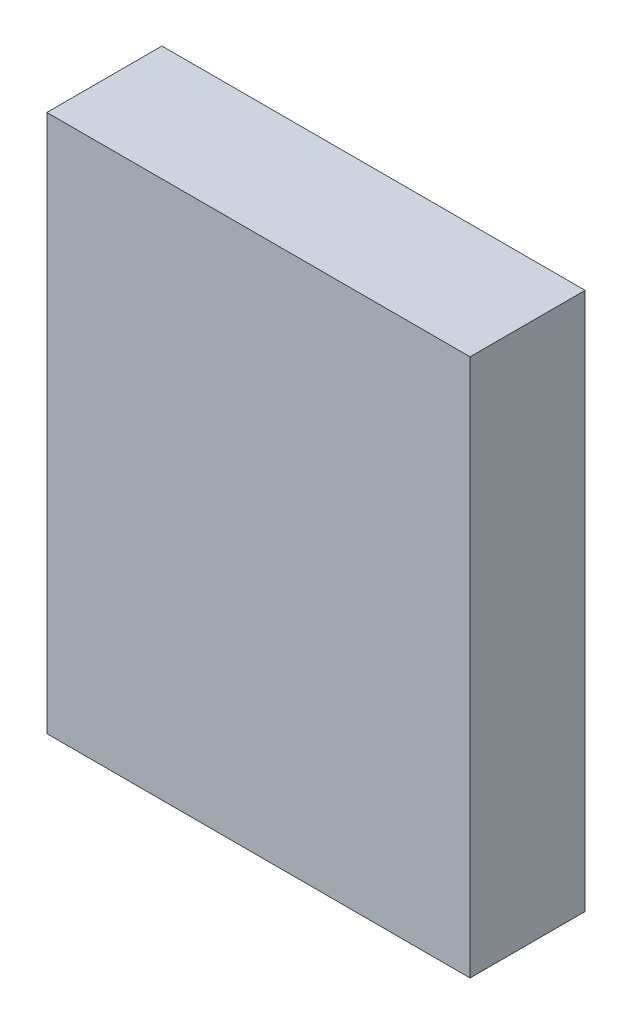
ISO-10303-21;
HEADER;
FILE_DESCRIPTION(('STEP AP214'),'2;1');
FILE_NAME('part.step','',(''),(''),'','','');
FILE_SCHEMA(('AUTOMOTIVE_DESIGN { 1 0 10303 214 1 1 1 1 }'));
ENDSEC;
DATA;
#1=APPLICATION_CONTEXT('core data for automotive mechanical design processes');
#2=APPLICATION_PROTOCOL_DEFINITION('international standard','automotive_design',2000,#1);
#3=PRODUCT_CONTEXT('',#1,'mechanical');
#4=PRODUCT('Part','Part','',(#3));
#5=PRODUCT_RELATED_PRODUCT_CATEGORY('part','',(#4));
#6=PRODUCT_DEFINITION_FORMATION('','',#4);
#7=PRODUCT_DEFINITION_CONTEXT('part definition',#1,'design');
#8=PRODUCT_DEFINITION('design','',#6,#7);
#9=PRODUCT_DEFINITION_SHAPE('','',#8);
#10=(LENGTH_UNIT() NAMED_UNIT(*) SI_UNIT(.MILLI.,.METRE.));
#11=(NAMED_UNIT(*) PLANE_ANGLE_UNIT() SI_UNIT($,.RADIAN.));
#12=(NAMED_UNIT(*) SI_UNIT($,.STERADIAN.) SOLID_ANGLE_UNIT());
#13=UNCERTAINTY_MEASURE_WITH_UNIT(LENGTH_MEASURE(1.E-05),#10,'distance_accuracy_value','');
#14=(GEOMETRIC_REPRESENTATION_CONTEXT(3) GLOBAL_UNCERTAINTY_ASSIGNED_CONTEXT((#13)) GLOBAL_UNIT_ASSIGNED_CONTEXT((#10,
#11,#12)) REPRESENTATION_CONTEXT('',''));
#15=CARTESIAN_POINT('',(0.,0.,0.));
#16=DIRECTION('',(0.,0.,1.));
#17=DIRECTION('',(1.,0.,0.));
#18=AXIS2_PLACEMENT_3D('',#15,#16,#17);
#19=CARTESIAN_POINT('',(0.,0.,0.750000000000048));
#20=DIRECTION('',(0.,0.,1.));
#21=DIRECTION('',(1.,0.,0.));
#22=AXIS2_PLACEMENT_3D('',#19,#20,#21);
#23=PLANE('',#22);
#24=DIRECTION('',(0.,1.,0.));
#25=VECTOR('',#24,1.);
#26=CARTESIAN_POINT('',(-1.37500000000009,1.75600000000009,0.750000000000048));
#27=LINE('',#26,#25);
#28=CARTESIAN_POINT('',(-1.37500000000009,-1.75000000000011,0.750000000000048));
#29=VERTEX_POINT('',#28);
#30=CARTESIAN_POINT('',(-1.37500000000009,1.75600000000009,0.750000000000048));
#31=VERTEX_POINT('',#30);
#32=EDGE_CURVE('E67',#29,#31,#27,.T.);
#33=ORIENTED_EDGE('',*,*,#32,.F.);
#34=DIRECTION('',(1.,0.,0.));
#35=VECTOR('',#34,1.);
#36=CARTESIAN_POINT('',(-1.37500000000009,-1.75000000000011,0.750000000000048));
#37=LINE('',#36,#35);
#38=CARTESIAN_POINT('',(1.38300000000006,-1.75000000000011,0.750000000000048));
#39=VERTEX_POINT('',#38);
#40=EDGE_CURVE('E19',#39,#29,#37,.F.);
#41=ORIENTED_EDGE('',*,*,#40,.F.);
#42=DIRECTION('',(0.,1.,0.));
#43=VECTOR('',#42,1.);
#44=CARTESIAN_POINT('',(1.38300000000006,-1.75000000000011,0.750000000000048));
#45=LINE('',#44,#43);
#46=CARTESIAN_POINT('',(1.38300000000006,1.75600000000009,0.750000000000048));
#47=VERTEX_POINT('',#46);
#48=EDGE_CURVE('E57',#47,#39,#45,.F.);
#49=ORIENTED_EDGE('',*,*,#48,.F.);
#50=DIRECTION('',(1.,0.,0.));
#51=VECTOR('',#50,1.);
#52=CARTESIAN_POINT('',(1.38300000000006,1.75600000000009,0.750000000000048));
#53=LINE('',#52,#51);
#54=EDGE_CURVE('E52',#31,#47,#53,.T.);
#55=ORIENTED_EDGE('',*,*,#54,.F.);
#56=EDGE_LOOP('',(#33,#41,#49,#55));
#57=FACE_BOUND('',#56,.T.);
#58=ADVANCED_FACE('F16',(#57),#23,.T.);
#59=CARTESIAN_POINT('',(-1.37500000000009,-1.75000000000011,0.));
#60=DIRECTION('',(0.,-1.,0.));
#61=DIRECTION('',(0.,0.,-1.));
#62=AXIS2_PLACEMENT_3D('',#59,#60,#61);
#63=PLANE('',#62);
#64=DIRECTION('',(0.,0.,1.));
#65=VECTOR('',#64,1.);
#66=CARTESIAN_POINT('',(-1.37500000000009,-1.75000000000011,0.));
#67=LINE('',#66,#65);
#68=CARTESIAN_POINT('',(-1.37500000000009,-1.75000000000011,0.));
#69=VERTEX_POINT('',#68);
#70=EDGE_CURVE('E78',#69,#29,#67,.T.);
#71=ORIENTED_EDGE('',*,*,#70,.F.);
#72=DIRECTION('',(1.,0.,0.));
#73=VECTOR('',#72,1.);
#74=CARTESIAN_POINT('',(0.,-1.75000000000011,0.));
#75=LINE('',#74,#73);
#76=CARTESIAN_POINT('',(1.38300000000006,-1.75000000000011,0.));
#77=VERTEX_POINT('',#76);
#78=EDGE_CURVE('E73',#69,#77,#75,.T.);
#79=ORIENTED_EDGE('',*,*,#78,.T.);
#80=DIRECTION('',(0.,0.,-1.));
#81=VECTOR('',#80,1.);
#82=CARTESIAN_POINT('',(1.38300000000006,-1.75000000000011,0.));
#83=LINE('',#82,#81);
#84=EDGE_CURVE('E62',#39,#77,#83,.T.);
#85=ORIENTED_EDGE('',*,*,#84,.F.);
#86=ORIENTED_EDGE('',*,*,#40,.T.);
#87=EDGE_LOOP('',(#71,#79,#85,#86));
#88=FACE_BOUND('',#87,.T.);
#89=ADVANCED_FACE('F72',(#88),#63,.T.);
#90=CARTESIAN_POINT('',(1.38300000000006,-1.75000000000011,0.));
#91=DIRECTION('',(1.,0.,0.));
#92=DIRECTION('',(0.,0.,-1.));
#93=AXIS2_PLACEMENT_3D('',#90,#91,#92);
#94=PLANE('',#93);
#95=ORIENTED_EDGE('',*,*,#84,.T.);
#96=DIRECTION('',(0.,1.,0.));
#97=VECTOR('',#96,1.);
#98=CARTESIAN_POINT('',(1.38300000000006,0.,0.));
#99=LINE('',#98,#97);
#100=CARTESIAN_POINT('',(1.38300000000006,1.75600000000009,0.));
#101=VERTEX_POINT('',#100);
#102=EDGE_CURVE('E83',#77,#101,#99,.T.);
#103=ORIENTED_EDGE('',*,*,#102,.T.);
#104=DIRECTION('',(0.,0.,1.));
#105=VECTOR('',#104,1.);
#106=CARTESIAN_POINT('',(1.38300000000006,1.75600000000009,0.));
#107=LINE('',#106,#105);
#108=EDGE_CURVE('E64',#47,#101,#107,.F.);
#109=ORIENTED_EDGE('',*,*,#108,.F.);
#110=ORIENTED_EDGE('',*,*,#48,.T.);
#111=EDGE_LOOP('',(#95,#103,#109,#110));
#112=FACE_BOUND('',#111,.T.);
#113=ADVANCED_FACE('F59',(#112),#94,.T.);
#114=CARTESIAN_POINT('',(1.38300000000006,1.75600000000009,0.));
#115=DIRECTION('',(0.,1.,0.));
#116=DIRECTION('',(0.,0.,1.));
#117=AXIS2_PLACEMENT_3D('',#114,#115,#116);
#118=PLANE('',#117);
#119=ORIENTED_EDGE('',*,*,#108,.T.);
#120=DIRECTION('',(1.,0.,0.));
#121=VECTOR('',#120,1.);
#122=CARTESIAN_POINT('',(0.,1.75600000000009,0.));
#123=LINE('',#122,#121);
#124=CARTESIAN_POINT('',(-1.37500000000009,1.75600000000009,0.));
#125=VERTEX_POINT('',#124);
#126=EDGE_CURVE('E25',#101,#125,#123,.F.);
#127=ORIENTED_EDGE('',*,*,#126,.T.);
#128=DIRECTION('',(0.,0.,1.));
#129=VECTOR('',#128,1.);
#130=CARTESIAN_POINT('',(-1.37500000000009,1.75600000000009,0.));
#131=LINE('',#130,#129);
#132=EDGE_CURVE('E33',#31,#125,#131,.F.);
#133=ORIENTED_EDGE('',*,*,#132,.F.);
#134=ORIENTED_EDGE('',*,*,#54,.T.);
#135=EDGE_LOOP('',(#119,#127,#133,#134));
#136=FACE_BOUND('',#135,.T.);
#137=ADVANCED_FACE('F87',(#136),#118,.T.);
#138=CARTESIAN_POINT('',(-1.37500000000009,1.75600000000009,0.));
#139=DIRECTION('',(-1.,0.,0.));
#140=DIRECTION('',(0.,0.,1.));
#141=AXIS2_PLACEMENT_3D('',#138,#139,#140);
#142=PLANE('',#141);
#143=ORIENTED_EDGE('',*,*,#132,.T.);
#144=DIRECTION('',(0.,1.,0.));
#145=VECTOR('',#144,1.);
#146=CARTESIAN_POINT('',(-1.37500000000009,0.,0.));
#147=LINE('',#146,#145);
#148=EDGE_CURVE('E11',#125,#69,#147,.F.);
#149=ORIENTED_EDGE('',*,*,#148,.T.);
#150=ORIENTED_EDGE('',*,*,#70,.T.);
#151=ORIENTED_EDGE('',*,*,#32,.T.);
#152=EDGE_LOOP('',(#143,#149,#150,#151));
#153=FACE_BOUND('',#152,.T.);
#154=ADVANCED_FACE('F90',(#153),#142,.T.);
#155=CARTESIAN_POINT('',(0.,0.,0.));
#156=DIRECTION('',(0.,0.,1.));
#157=DIRECTION('',(1.,0.,0.));
#158=AXIS2_PLACEMENT_3D('',#155,#156,#157);
#159=PLANE('',#158);
#160=ORIENTED_EDGE('',*,*,#126,.F.);
#161=ORIENTED_EDGE('',*,*,#102,.F.);
#162=ORIENTED_EDGE('',*,*,#78,.F.);
#163=ORIENTED_EDGE('',*,*,#148,.F.);
#164=EDGE_LOOP('',(#160,#161,#162,#163));
#165=FACE_BOUND('',#164,.T.);
#166=ADVANCED_FACE('F89',(#165),#159,.F.);
#167=CLOSED_SHELL('',(#58,#89,#113,#137,#154,#166));
#168=MANIFOLD_SOLID_BREP('B1',#167);
#169=ADVANCED_BREP_SHAPE_REPRESENTATION('',(#18,#168),#14);
#170=SHAPE_DEFINITION_REPRESENTATION(#9,#169);
ENDSEC;
END-ISO-10303-21;
